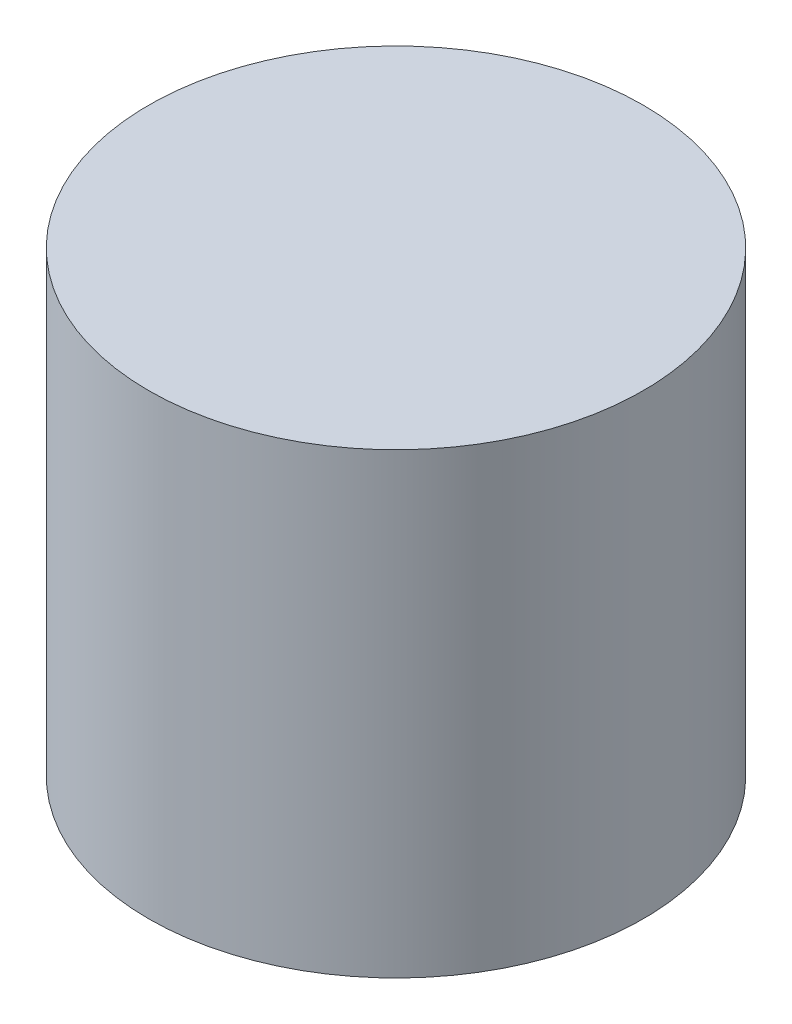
ISO-10303-21;
HEADER;
FILE_DESCRIPTION(('STEP AP214'),'2;1');
FILE_NAME('part.step','',(''),(''),'','','');
FILE_SCHEMA(('AUTOMOTIVE_DESIGN { 1 0 10303 214 1 1 1 1 }'));
ENDSEC;
DATA;
#1=APPLICATION_CONTEXT('core data for automotive mechanical design processes');
#2=APPLICATION_PROTOCOL_DEFINITION('international standard','automotive_design',2000,#1);
#3=PRODUCT_CONTEXT('',#1,'mechanical');
#4=PRODUCT('Part','Part','',(#3));
#5=PRODUCT_RELATED_PRODUCT_CATEGORY('part','',(#4));
#6=PRODUCT_DEFINITION_FORMATION('','',#4);
#7=PRODUCT_DEFINITION_CONTEXT('part definition',#1,'design');
#8=PRODUCT_DEFINITION('design','',#6,#7);
#9=PRODUCT_DEFINITION_SHAPE('','',#8);
#10=(LENGTH_UNIT() NAMED_UNIT(*) SI_UNIT(.MILLI.,.METRE.));
#11=(NAMED_UNIT(*) PLANE_ANGLE_UNIT() SI_UNIT($,.RADIAN.));
#12=(NAMED_UNIT(*) SI_UNIT($,.STERADIAN.) SOLID_ANGLE_UNIT());
#13=UNCERTAINTY_MEASURE_WITH_UNIT(LENGTH_MEASURE(1.E-05),#10,'distance_accuracy_value','');
#14=(GEOMETRIC_REPRESENTATION_CONTEXT(3) GLOBAL_UNCERTAINTY_ASSIGNED_CONTEXT((#13)) GLOBAL_UNIT_ASSIGNED_CONTEXT((#10,
#11,#12)) REPRESENTATION_CONTEXT('',''));
#15=CARTESIAN_POINT('',(0.,0.,0.));
#16=DIRECTION('',(0.,0.,1.));
#17=DIRECTION('',(1.,0.,0.));
#18=AXIS2_PLACEMENT_3D('',#15,#16,#17);
#19=CARTESIAN_POINT('',(0.,18.5,0.));
#20=DIRECTION('',(0.,-1.,0.));
#21=DIRECTION('',(0.,0.,-1.));
#22=AXIS2_PLACEMENT_3D('',#19,#20,#21);
#23=CYLINDRICAL_SURFACE('',#22,10.);
#24=CARTESIAN_POINT('',(0.,18.5,0.));
#25=DIRECTION('',(0.,1.,0.));
#26=DIRECTION('',(0.,0.,1.));
#27=AXIS2_PLACEMENT_3D('',#24,#25,#26);
#28=CIRCLE('',#27,10.);
#29=CARTESIAN_POINT('',(0.,18.5,10.));
#30=VERTEX_POINT('',#29);
#31=EDGE_CURVE('E10',#30,#30,#28,.T.);
#32=ORIENTED_EDGE('',*,*,#31,.F.);
#33=EDGE_LOOP('',(#32));
#34=FACE_BOUND('',#33,.T.);
#35=CARTESIAN_POINT('',(0.,0.,0.));
#36=DIRECTION('',(0.,1.,0.));
#37=DIRECTION('',(0.,0.,1.));
#38=AXIS2_PLACEMENT_3D('',#35,#36,#37);
#39=CIRCLE('',#38,10.);
#40=CARTESIAN_POINT('',(0.,0.,10.));
#41=VERTEX_POINT('',#40);
#42=EDGE_CURVE('E44',#41,#41,#39,.T.);
#43=ORIENTED_EDGE('',*,*,#42,.T.);
#44=EDGE_LOOP('',(#43));
#45=FACE_BOUND('',#44,.T.);
#46=ADVANCED_FACE('F41',(#34,#45),#23,.T.);
#47=CARTESIAN_POINT('',(0.,18.5,0.));
#48=DIRECTION('',(0.,1.,0.));
#49=DIRECTION('',(0.,0.,1.));
#50=AXIS2_PLACEMENT_3D('',#47,#48,#49);
#51=PLANE('',#50);
#52=ORIENTED_EDGE('',*,*,#31,.T.);
#53=EDGE_LOOP('',(#52));
#54=FACE_BOUND('',#53,.T.);
#55=ADVANCED_FACE('F58',(#54),#51,.T.);
#56=CARTESIAN_POINT('',(0.,0.,0.));
#57=DIRECTION('',(0.,1.,0.));
#58=DIRECTION('',(0.,0.,1.));
#59=AXIS2_PLACEMENT_3D('',#56,#57,#58);
#60=PLANE('',#59);
#61=ORIENTED_EDGE('',*,*,#42,.F.);
#62=EDGE_LOOP('',(#61));
#63=FACE_BOUND('',#62,.T.);
#64=ADVANCED_FACE('F56',(#63),#60,.F.);
#65=CLOSED_SHELL('',(#46,#55,#64));
#66=MANIFOLD_SOLID_BREP('B2',#65);
#67=ADVANCED_BREP_SHAPE_REPRESENTATION('',(#18,#66),#14);
#68=SHAPE_DEFINITION_REPRESENTATION(#9,#67);
ENDSEC;
END-ISO-10303-21;
